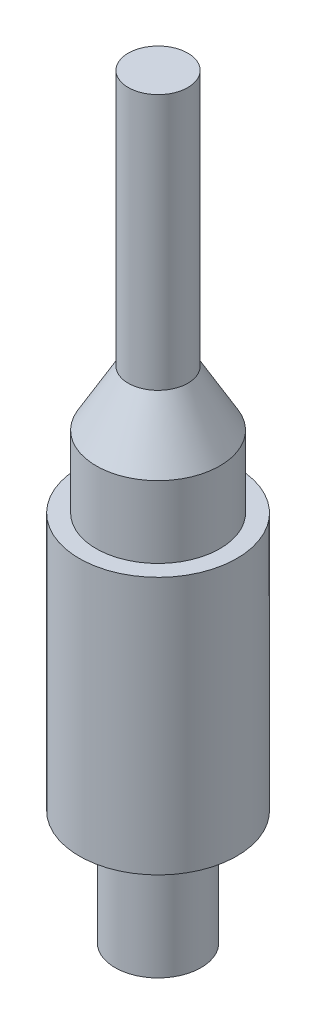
ISO-10303-21;
HEADER;
FILE_DESCRIPTION(('STEP AP214'),'2;1');
FILE_NAME('part.step','',(''),(''),'','','');
FILE_SCHEMA(('AUTOMOTIVE_DESIGN { 1 0 10303 214 1 1 1 1 }'));
ENDSEC;
DATA;
#1=APPLICATION_CONTEXT('core data for automotive mechanical design processes');
#2=APPLICATION_PROTOCOL_DEFINITION('international standard','automotive_design',2000,#1);
#3=PRODUCT_CONTEXT('',#1,'mechanical');
#4=PRODUCT('Part','Part','',(#3));
#5=PRODUCT_RELATED_PRODUCT_CATEGORY('part','',(#4));
#6=PRODUCT_DEFINITION_FORMATION('','',#4);
#7=PRODUCT_DEFINITION_CONTEXT('part definition',#1,'design');
#8=PRODUCT_DEFINITION('design','',#6,#7);
#9=PRODUCT_DEFINITION_SHAPE('','',#8);
#10=(LENGTH_UNIT() NAMED_UNIT(*) SI_UNIT(.MILLI.,.METRE.));
#11=(NAMED_UNIT(*) PLANE_ANGLE_UNIT() SI_UNIT($,.RADIAN.));
#12=(NAMED_UNIT(*) SI_UNIT($,.STERADIAN.) SOLID_ANGLE_UNIT());
#13=UNCERTAINTY_MEASURE_WITH_UNIT(LENGTH_MEASURE(1.E-05),#10,'distance_accuracy_value','');
#14=(GEOMETRIC_REPRESENTATION_CONTEXT(3) GLOBAL_UNCERTAINTY_ASSIGNED_CONTEXT((#13)) GLOBAL_UNIT_ASSIGNED_CONTEXT((#10,
#11,#12)) REPRESENTATION_CONTEXT('',''));
#15=CARTESIAN_POINT('',(0.,0.,0.));
#16=DIRECTION('',(0.,0.,1.));
#17=DIRECTION('',(1.,0.,0.));
#18=AXIS2_PLACEMENT_3D('',#15,#16,#17);
#19=CARTESIAN_POINT('',(0.,-12.7,0.));
#20=DIRECTION('',(0.,-1.,0.));
#21=DIRECTION('',(0.,0.,-1.));
#22=AXIS2_PLACEMENT_3D('',#19,#20,#21);
#23=PLANE('',#22);
#24=CARTESIAN_POINT('',(0.,-12.7,0.));
#25=DIRECTION('',(0.,-1.,0.));
#26=DIRECTION('',(0.,0.,-1.));
#27=AXIS2_PLACEMENT_3D('',#24,#25,#26);
#28=CIRCLE('',#27,4.7625);
#29=CARTESIAN_POINT('',(0.,-12.7,-4.7625));
#30=VERTEX_POINT('',#29);
#31=EDGE_CURVE('E10',#30,#30,#28,.T.);
#32=ORIENTED_EDGE('',*,*,#31,.T.);
#33=EDGE_LOOP('',(#32));
#34=FACE_BOUND('',#33,.T.);
#35=ADVANCED_FACE('F30',(#34),#23,.T.);
#36=CARTESIAN_POINT('',(0.,-12.9330718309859,0.));
#37=DIRECTION('',(0.,-1.,0.));
#38=DIRECTION('',(0.,0.,-1.));
#39=AXIS2_PLACEMENT_3D('',#36,#37,#38);
#40=CYLINDRICAL_SURFACE('',#39,4.7625);
#41=CARTESIAN_POINT('',(0.,0.,0.));
#42=DIRECTION('',(0.,-1.,0.));
#43=DIRECTION('',(0.,0.,-1.));
#44=AXIS2_PLACEMENT_3D('',#41,#42,#43);
#45=CIRCLE('',#44,4.7625);
#46=CARTESIAN_POINT('',(0.,0.,-4.7625));
#47=VERTEX_POINT('',#46);
#48=EDGE_CURVE('E36',#47,#47,#45,.T.);
#49=ORIENTED_EDGE('',*,*,#48,.T.);
#50=EDGE_LOOP('',(#49));
#51=FACE_BOUND('',#50,.T.);
#52=ORIENTED_EDGE('',*,*,#31,.F.);
#53=EDGE_LOOP('',(#52));
#54=FACE_BOUND('',#53,.T.);
#55=ADVANCED_FACE('F74',(#51,#54),#40,.T.);
#56=CARTESIAN_POINT('',(4.7625,0.,0.));
#57=DIRECTION('',(0.,-1.,0.));
#58=DIRECTION('',(0.,0.,-1.));
#59=AXIS2_PLACEMENT_3D('',#56,#57,#58);
#60=PLANE('',#59);
#61=CARTESIAN_POINT('',(0.,0.,0.));
#62=DIRECTION('',(0.,-1.,0.));
#63=DIRECTION('',(0.,0.,-1.));
#64=AXIS2_PLACEMENT_3D('',#61,#62,#63);
#65=CIRCLE('',#64,8.7376);
#66=CARTESIAN_POINT('',(0.,0.,-8.7376));
#67=VERTEX_POINT('',#66);
#68=EDGE_CURVE('E40',#67,#67,#65,.T.);
#69=ORIENTED_EDGE('',*,*,#68,.T.);
#70=EDGE_LOOP('',(#69));
#71=FACE_BOUND('',#70,.T.);
#72=ORIENTED_EDGE('',*,*,#48,.F.);
#73=EDGE_LOOP('',(#72));
#74=FACE_BOUND('',#73,.T.);
#75=ADVANCED_FACE('F78',(#71,#74),#60,.T.);
#76=CARTESIAN_POINT('',(0.,-12.9330718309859,0.));
#77=DIRECTION('',(0.,-1.,0.));
#78=DIRECTION('',(0.,0.,-1.));
#79=AXIS2_PLACEMENT_3D('',#76,#77,#78);
#80=CYLINDRICAL_SURFACE('',#79,8.7376);
#81=CARTESIAN_POINT('',(0.,28.575,0.));
#82=DIRECTION('',(0.,-1.,0.));
#83=DIRECTION('',(0.,0.,-1.));
#84=AXIS2_PLACEMENT_3D('',#81,#82,#83);
#85=CIRCLE('',#84,8.7376);
#86=CARTESIAN_POINT('',(0.,28.575,-8.7376));
#87=VERTEX_POINT('',#86);
#88=EDGE_CURVE('E44',#87,#87,#85,.T.);
#89=ORIENTED_EDGE('',*,*,#88,.T.);
#90=EDGE_LOOP('',(#89));
#91=FACE_BOUND('',#90,.T.);
#92=ORIENTED_EDGE('',*,*,#68,.F.);
#93=EDGE_LOOP('',(#92));
#94=FACE_BOUND('',#93,.T.);
#95=ADVANCED_FACE('F82',(#91,#94),#80,.T.);
#96=CARTESIAN_POINT('',(8.7376,28.575,0.));
#97=DIRECTION('',(0.,1.,0.));
#98=DIRECTION('',(0.,0.,1.));
#99=AXIS2_PLACEMENT_3D('',#96,#97,#98);
#100=PLANE('',#99);
#101=CARTESIAN_POINT('',(0.,28.575,0.));
#102=DIRECTION('',(0.,-1.,0.));
#103=DIRECTION('',(0.,0.,-1.));
#104=AXIS2_PLACEMENT_3D('',#101,#102,#103);
#105=CIRCLE('',#104,6.858);
#106=CARTESIAN_POINT('',(0.,28.575,-6.858));
#107=VERTEX_POINT('',#106);
#108=EDGE_CURVE('E49',#107,#107,#105,.T.);
#109=ORIENTED_EDGE('',*,*,#108,.T.);
#110=EDGE_LOOP('',(#109));
#111=FACE_BOUND('',#110,.T.);
#112=ORIENTED_EDGE('',*,*,#88,.F.);
#113=EDGE_LOOP('',(#112));
#114=FACE_BOUND('',#113,.T.);
#115=ADVANCED_FACE('F89',(#111,#114),#100,.T.);
#116=CARTESIAN_POINT('',(0.,-12.9330718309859,0.));
#117=DIRECTION('',(0.,-1.,0.));
#118=DIRECTION('',(0.,0.,-1.));
#119=AXIS2_PLACEMENT_3D('',#116,#117,#118);
#120=CYLINDRICAL_SURFACE('',#119,6.858);
#121=CARTESIAN_POINT('',(0.,36.5252,0.));
#122=DIRECTION('',(0.,-1.,0.));
#123=DIRECTION('',(0.,0.,-1.));
#124=AXIS2_PLACEMENT_3D('',#121,#122,#123);
#125=CIRCLE('',#124,6.858);
#126=CARTESIAN_POINT('',(0.,36.5252,-6.858));
#127=VERTEX_POINT('',#126);
#128=EDGE_CURVE('E52',#127,#127,#125,.T.);
#129=ORIENTED_EDGE('',*,*,#128,.T.);
#130=EDGE_LOOP('',(#129));
#131=FACE_BOUND('',#130,.T.);
#132=ORIENTED_EDGE('',*,*,#108,.F.);
#133=EDGE_LOOP('',(#132));
#134=FACE_BOUND('',#133,.T.);
#135=ADVANCED_FACE('F93',(#131,#134),#120,.T.);
#136=CARTESIAN_POINT('',(0.,36.5252,0.));
#137=DIRECTION('',(0.,-1.,0.));
#138=DIRECTION('',(0.,0.,-1.));
#139=AXIS2_PLACEMENT_3D('',#136,#137,#138);
#140=CONICAL_SURFACE('',#139,6.858,0.523598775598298);
#141=CARTESIAN_POINT('',(0.,42.6811542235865,0.));
#142=DIRECTION('',(0.,-1.,0.));
#143=DIRECTION('',(0.,0.,-1.));
#144=AXIS2_PLACEMENT_3D('',#141,#142,#143);
#145=CIRCLE('',#144,3.30385817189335);
#146=CARTESIAN_POINT('',(0.,42.6811542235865,-3.30385817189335));
#147=VERTEX_POINT('',#146);
#148=EDGE_CURVE('E55',#147,#147,#145,.T.);
#149=ORIENTED_EDGE('',*,*,#148,.T.);
#150=EDGE_LOOP('',(#149));
#151=FACE_BOUND('',#150,.T.);
#152=ORIENTED_EDGE('',*,*,#128,.F.);
#153=EDGE_LOOP('',(#152));
#154=FACE_BOUND('',#153,.T.);
#155=ADVANCED_FACE('F71',(#151,#154),#140,.T.);
#156=CARTESIAN_POINT('',(0.,-12.9330718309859,0.));
#157=DIRECTION('',(0.,-1.,0.));
#158=DIRECTION('',(0.,0.,-1.));
#159=AXIS2_PLACEMENT_3D('',#156,#157,#158);
#160=CYLINDRICAL_SURFACE('',#159,3.30385817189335);
#161=CARTESIAN_POINT('',(0.,71.0724686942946,0.));
#162=DIRECTION('',(0.,-1.,0.));
#163=DIRECTION('',(0.,0.,-1.));
#164=AXIS2_PLACEMENT_3D('',#161,#162,#163);
#165=CIRCLE('',#164,3.30385817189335);
#166=CARTESIAN_POINT('',(0.,71.0724686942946,-3.30385817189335));
#167=VERTEX_POINT('',#166);
#168=EDGE_CURVE('E58',#167,#167,#165,.T.);
#169=ORIENTED_EDGE('',*,*,#168,.T.);
#170=EDGE_LOOP('',(#169));
#171=FACE_BOUND('',#170,.T.);
#172=ORIENTED_EDGE('',*,*,#148,.F.);
#173=EDGE_LOOP('',(#172));
#174=FACE_BOUND('',#173,.T.);
#175=ADVANCED_FACE('F62',(#171,#174),#160,.T.);
#176=CARTESIAN_POINT('',(3.30385817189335,71.0724686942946,0.));
#177=DIRECTION('',(0.,1.,0.));
#178=DIRECTION('',(0.,0.,1.));
#179=AXIS2_PLACEMENT_3D('',#176,#177,#178);
#180=PLANE('',#179);
#181=ORIENTED_EDGE('',*,*,#168,.F.);
#182=EDGE_LOOP('',(#181));
#183=FACE_BOUND('',#182,.T.);
#184=ADVANCED_FACE('F65',(#183),#180,.T.);
#185=CLOSED_SHELL('',(#35,#55,#75,#95,#115,#135,#155,#175,#184));
#186=MANIFOLD_SOLID_BREP('B2',#185);
#187=ADVANCED_BREP_SHAPE_REPRESENTATION('',(#18,#186),#14);
#188=SHAPE_DEFINITION_REPRESENTATION(#9,#187);
ENDSEC;
END-ISO-10303-21;
